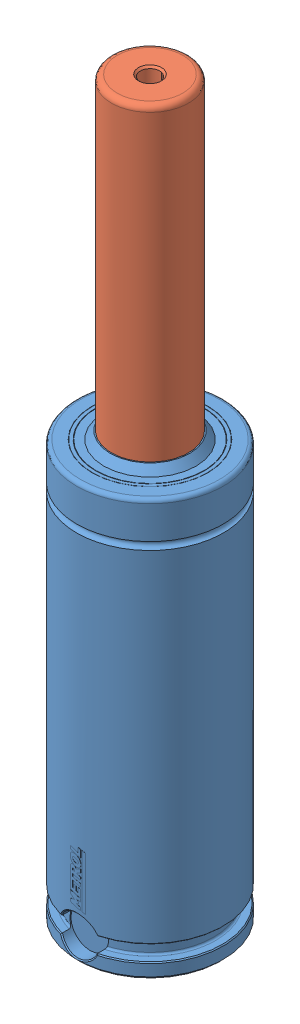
SolidWorks assembly EX0500-080.SLDASM, configuration Default (file format 7000). Lengths in mm.
Overall size (41.68 190 41.68).
2 component instances, 2 part files, 5 mates.
Components (placement in the parent):
- EX0500 Body-1: EX0500 Body.SLDPRT [EX-500-080] x (0 0 1) z (0 -1 0) size (38.1 38 110)
- EX-500 Piston-1: EX-500 Piston.SLDPRT [EX-500-080] at (0 93 0) x (-0.5621 0 -0.827069) z (0 -1 0) size (30 30 97)
Mates (geometry in assembly coordinates):
- Concentric1: concentric aligned: cylinder of EX0500 Body-1 through (0 0 0) axis (0 -1 0) radius 10; cylinder of EX-500 Piston-1 through (0 93 0) axis (0 -1 0) radius 10
- LimitDistance1: limit distance anti-aligned: plane of EX0500 Body-1 through (0 98 0) normal (0 -1 0); plane of EX-500 Piston-1 through (12.406 98 -8.4315) normal (0 1 0)
- Coincident1: coincident anti-aligned: plane of EX0500 Body-1 through (0 0 0) normal (0 -1 0); plane of assembly through (0 0 0) normal (0 1 0)
- Coincident2: coincident anti-aligned: plane of EX0500 Body-1; plane of assembly through (0 0 0) normal (1 0 0)
- Coincident4: coincident aligned: plane of EX0500 Body-1; plane of assembly through (0 0 0) normal (0 0 1)
